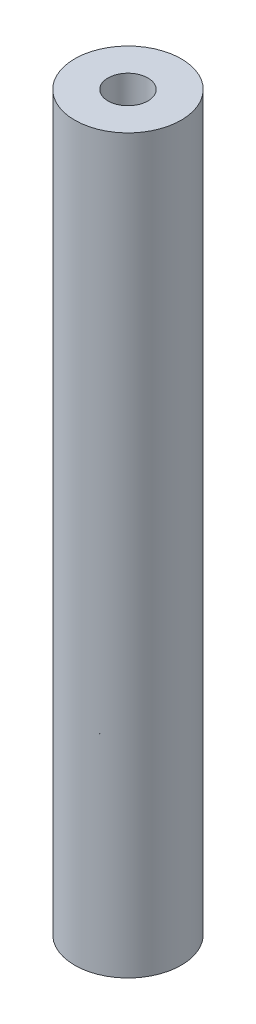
ISO-10303-21;
HEADER;
FILE_DESCRIPTION(('STEP AP214'),'2;1');
FILE_NAME('part.step','',(''),(''),'','','');
FILE_SCHEMA(('AUTOMOTIVE_DESIGN { 1 0 10303 214 1 1 1 1 }'));
ENDSEC;
DATA;
#1=APPLICATION_CONTEXT('core data for automotive mechanical design processes');
#2=APPLICATION_PROTOCOL_DEFINITION('international standard','automotive_design',2000,#1);
#3=PRODUCT_CONTEXT('',#1,'mechanical');
#4=PRODUCT('Part','Part','',(#3));
#5=PRODUCT_RELATED_PRODUCT_CATEGORY('part','',(#4));
#6=PRODUCT_DEFINITION_FORMATION('','',#4);
#7=PRODUCT_DEFINITION_CONTEXT('part definition',#1,'design');
#8=PRODUCT_DEFINITION('design','',#6,#7);
#9=PRODUCT_DEFINITION_SHAPE('','',#8);
#10=(LENGTH_UNIT() NAMED_UNIT(*) SI_UNIT(.MILLI.,.METRE.));
#11=(NAMED_UNIT(*) PLANE_ANGLE_UNIT() SI_UNIT($,.RADIAN.));
#12=(NAMED_UNIT(*) SI_UNIT($,.STERADIAN.) SOLID_ANGLE_UNIT());
#13=UNCERTAINTY_MEASURE_WITH_UNIT(LENGTH_MEASURE(1.E-05),#10,'distance_accuracy_value','');
#14=(GEOMETRIC_REPRESENTATION_CONTEXT(3) GLOBAL_UNCERTAINTY_ASSIGNED_CONTEXT((#13)) GLOBAL_UNIT_ASSIGNED_CONTEXT((#10,
#11,#12)) REPRESENTATION_CONTEXT('',''));
#15=CARTESIAN_POINT('',(0.,0.,0.));
#16=DIRECTION('',(0.,0.,1.));
#17=DIRECTION('',(1.,0.,0.));
#18=AXIS2_PLACEMENT_3D('',#15,#16,#17);
#19=CARTESIAN_POINT('',(0.,55.,0.));
#20=DIRECTION('',(0.,-1.,0.));
#21=DIRECTION('',(0.,0.,-1.));
#22=AXIS2_PLACEMENT_3D('',#19,#20,#21);
#23=CYLINDRICAL_SURFACE('',#22,4.);
#24=CARTESIAN_POINT('',(0.,55.,0.));
#25=DIRECTION('',(0.,1.,0.));
#26=DIRECTION('',(0.,0.,1.));
#27=AXIS2_PLACEMENT_3D('',#24,#25,#26);
#28=CIRCLE('',#27,4.);
#29=CARTESIAN_POINT('',(0.,55.,4.));
#30=VERTEX_POINT('',#29);
#31=EDGE_CURVE('E10',#30,#30,#28,.T.);
#32=ORIENTED_EDGE('',*,*,#31,.F.);
#33=EDGE_LOOP('',(#32));
#34=FACE_BOUND('',#33,.T.);
#35=CARTESIAN_POINT('',(0.,0.,0.));
#36=DIRECTION('',(0.,1.,0.));
#37=DIRECTION('',(0.,0.,1.));
#38=AXIS2_PLACEMENT_3D('',#35,#36,#37);
#39=CIRCLE('',#38,4.);
#40=CARTESIAN_POINT('',(0.,0.,4.));
#41=VERTEX_POINT('',#40);
#42=EDGE_CURVE('E34',#41,#41,#39,.T.);
#43=ORIENTED_EDGE('',*,*,#42,.T.);
#44=EDGE_LOOP('',(#43));
#45=FACE_BOUND('',#44,.T.);
#46=ADVANCED_FACE('F31',(#34,#45),#23,.T.);
#47=CARTESIAN_POINT('',(0.,55.,0.));
#48=DIRECTION('',(0.,1.,0.));
#49=DIRECTION('',(0.,0.,1.));
#50=AXIS2_PLACEMENT_3D('',#47,#48,#49);
#51=PLANE('',#50);
#52=CARTESIAN_POINT('',(0.,55.,0.));
#53=DIRECTION('',(0.,1.,0.));
#54=DIRECTION('',(0.,0.,1.));
#55=AXIS2_PLACEMENT_3D('',#52,#53,#54);
#56=CIRCLE('',#55,1.5);
#57=CARTESIAN_POINT('',(0.,55.,1.5));
#58=VERTEX_POINT('',#57);
#59=EDGE_CURVE('E41',#58,#58,#56,.F.);
#60=ORIENTED_EDGE('',*,*,#59,.T.);
#61=EDGE_LOOP('',(#60));
#62=FACE_BOUND('',#61,.T.);
#63=ORIENTED_EDGE('',*,*,#31,.T.);
#64=EDGE_LOOP('',(#63));
#65=FACE_BOUND('',#64,.T.);
#66=ADVANCED_FACE('F55',(#62,#65),#51,.T.);
#67=CARTESIAN_POINT('',(0.,0.,0.));
#68=DIRECTION('',(0.,1.,0.));
#69=DIRECTION('',(0.,0.,1.));
#70=AXIS2_PLACEMENT_3D('',#67,#68,#69);
#71=PLANE('',#70);
#72=CARTESIAN_POINT('',(0.,0.,0.));
#73=DIRECTION('',(0.,-1.,0.));
#74=DIRECTION('',(0.,0.,-1.));
#75=AXIS2_PLACEMENT_3D('',#72,#73,#74);
#76=CIRCLE('',#75,1.5);
#77=CARTESIAN_POINT('',(0.,0.,-1.5));
#78=VERTEX_POINT('',#77);
#79=EDGE_CURVE('E45',#78,#78,#76,.T.);
#80=ORIENTED_EDGE('',*,*,#79,.F.);
#81=EDGE_LOOP('',(#80));
#82=FACE_BOUND('',#81,.T.);
#83=ORIENTED_EDGE('',*,*,#42,.F.);
#84=EDGE_LOOP('',(#83));
#85=FACE_BOUND('',#84,.T.);
#86=ADVANCED_FACE('F52',(#82,#85),#71,.F.);
#87=CARTESIAN_POINT('',(0.,59.2426406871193,0.));
#88=DIRECTION('',(0.,-1.,0.));
#89=DIRECTION('',(0.,0.,-1.));
#90=AXIS2_PLACEMENT_3D('',#87,#88,#89);
#91=CYLINDRICAL_SURFACE('',#90,1.5);
#92=ORIENTED_EDGE('',*,*,#79,.T.);
#93=EDGE_LOOP('',(#92));
#94=FACE_BOUND('',#93,.T.);
#95=ORIENTED_EDGE('',*,*,#59,.F.);
#96=EDGE_LOOP('',(#95));
#97=FACE_BOUND('',#96,.T.);
#98=ADVANCED_FACE('F49',(#94,#97),#91,.F.);
#99=CLOSED_SHELL('',(#46,#66,#86,#98));
#100=MANIFOLD_SOLID_BREP('B2',#99);
#101=ADVANCED_BREP_SHAPE_REPRESENTATION('',(#18,#100),#14);
#102=SHAPE_DEFINITION_REPRESENTATION(#9,#101);
ENDSEC;
END-ISO-10303-21;
